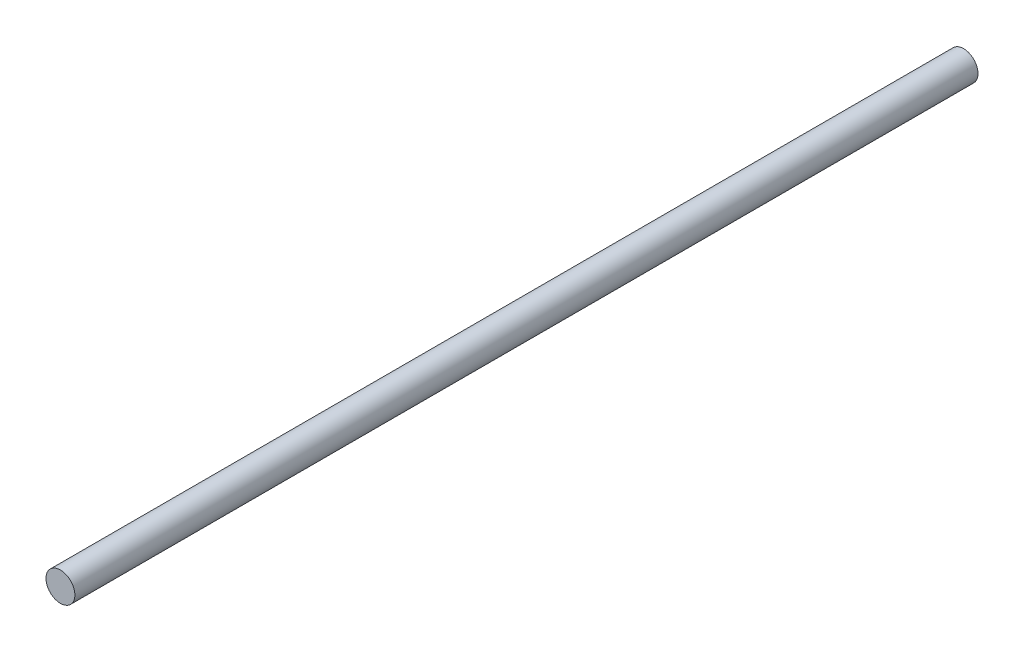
from build123d import *

# Parameters (mm, degrees)
SKETCH1_R           = 4
BOSS_EXTRUDE1_DEPTH = 125


with BuildPart() as part:
    # Sketch1 → Boss-Extrude1 (new, symmetric)
    with BuildSketch(Plane.XY):
        Circle(SKETCH1_R)
    extrude(amount=BOSS_EXTRUDE1_DEPTH, both=True)


solid = part.part
